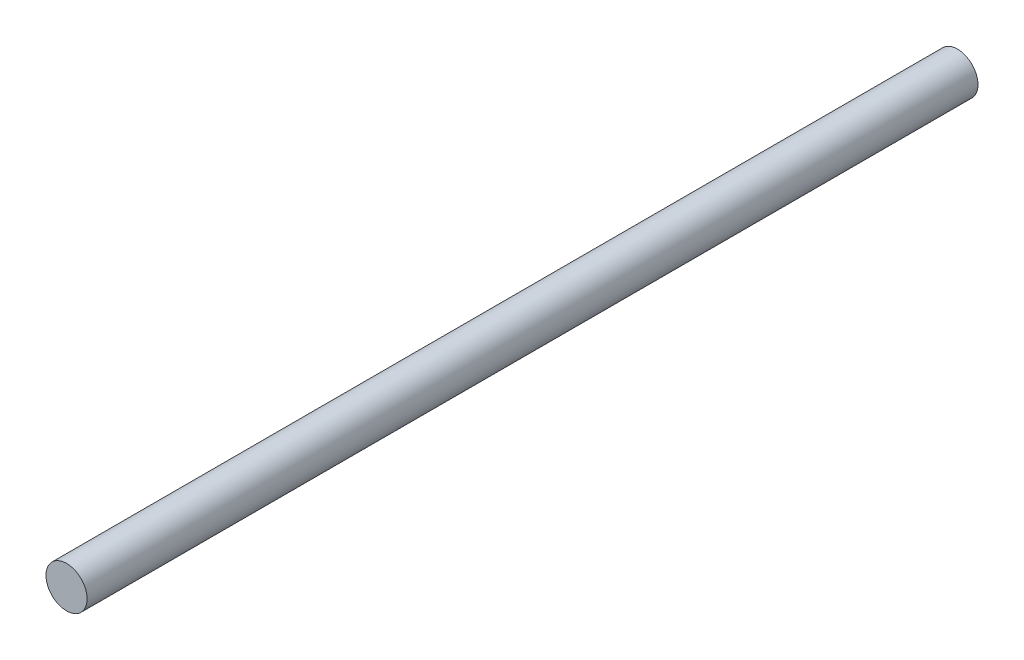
from build123d import *

# Parameters (mm, degrees)
SKETCH1_R      = 6.35
EXTRUDE1_DEPTH = 137.45083


with BuildPart() as part:
    # Sketch1 → Extrude1 (new, symmetric)
    with BuildSketch(Plane.XY):
        Circle(SKETCH1_R)
    extrude(amount=EXTRUDE1_DEPTH, both=True)


solid = part.part
